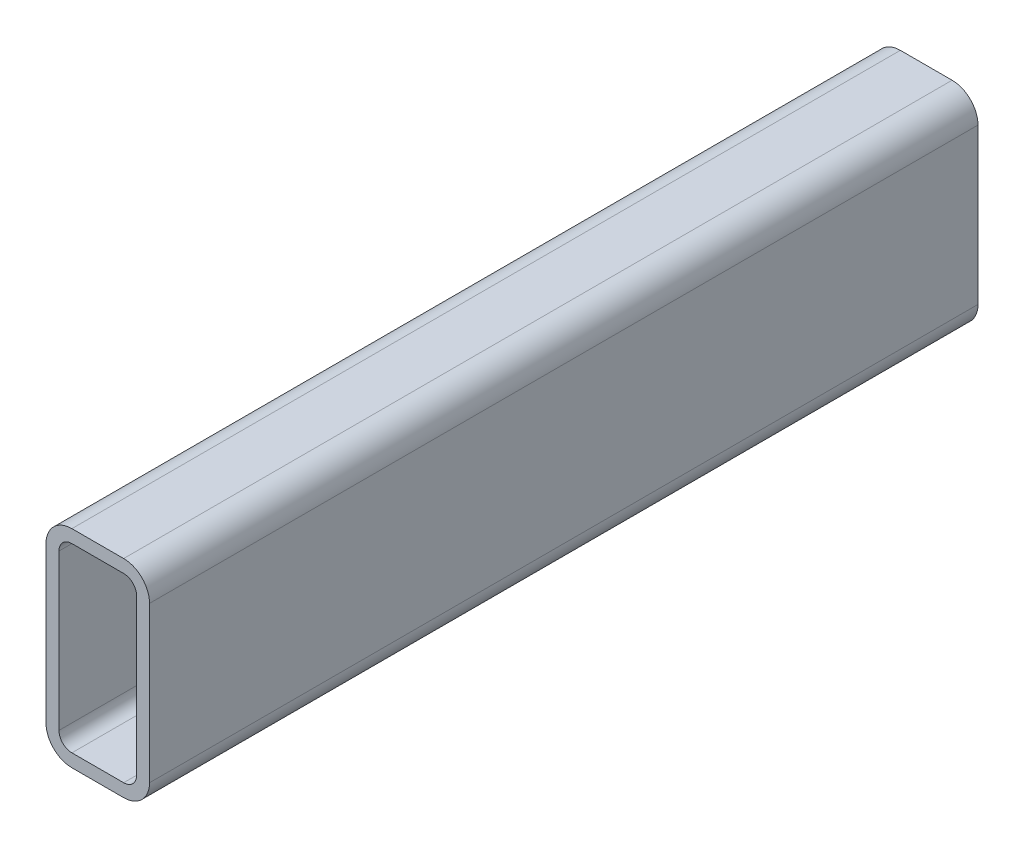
ISO-10303-21;
HEADER;
FILE_DESCRIPTION(('STEP AP214'),'2;1');
FILE_NAME('part.step','',(''),(''),'','','');
FILE_SCHEMA(('AUTOMOTIVE_DESIGN { 1 0 10303 214 1 1 1 1 }'));
ENDSEC;
DATA;
#1=APPLICATION_CONTEXT('core data for automotive mechanical design processes');
#2=APPLICATION_PROTOCOL_DEFINITION('international standard','automotive_design',2000,#1);
#3=PRODUCT_CONTEXT('',#1,'mechanical');
#4=PRODUCT('Part','Part','',(#3));
#5=PRODUCT_RELATED_PRODUCT_CATEGORY('part','',(#4));
#6=PRODUCT_DEFINITION_FORMATION('','',#4);
#7=PRODUCT_DEFINITION_CONTEXT('part definition',#1,'design');
#8=PRODUCT_DEFINITION('design','',#6,#7);
#9=PRODUCT_DEFINITION_SHAPE('','',#8);
#10=(LENGTH_UNIT() NAMED_UNIT(*) SI_UNIT(.MILLI.,.METRE.));
#11=(NAMED_UNIT(*) PLANE_ANGLE_UNIT() SI_UNIT($,.RADIAN.));
#12=(NAMED_UNIT(*) SI_UNIT($,.STERADIAN.) SOLID_ANGLE_UNIT());
#13=UNCERTAINTY_MEASURE_WITH_UNIT(LENGTH_MEASURE(1.E-05),#10,'distance_accuracy_value','');
#14=(GEOMETRIC_REPRESENTATION_CONTEXT(3) GLOBAL_UNCERTAINTY_ASSIGNED_CONTEXT((#13)) GLOBAL_UNIT_ASSIGNED_CONTEXT((#10,
#11,#12)) REPRESENTATION_CONTEXT('',''));
#15=CARTESIAN_POINT('',(0.,0.,0.));
#16=DIRECTION('',(0.,0.,1.));
#17=DIRECTION('',(1.,0.,0.));
#18=AXIS2_PLACEMENT_3D('',#15,#16,#17);
#19=CARTESIAN_POINT('',(9.525,66.675,304.8));
#20=DIRECTION('',(0.,0.,1.));
#21=DIRECTION('',(1.,0.,0.));
#22=AXIS2_PLACEMENT_3D('',#19,#20,#21);
#23=PLANE('',#22);
#24=CARTESIAN_POINT('',(9.525,66.675,304.8));
#25=DIRECTION('',(0.,0.,1.));
#26=DIRECTION('',(1.,0.,0.));
#27=AXIS2_PLACEMENT_3D('',#24,#25,#26);
#28=CIRCLE('',#27,9.52500000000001);
#29=CARTESIAN_POINT('',(9.525,76.2,304.8));
#30=VERTEX_POINT('',#29);
#31=CARTESIAN_POINT('',(0.,66.675,304.8));
#32=VERTEX_POINT('',#31);
#33=EDGE_CURVE('E211',#30,#32,#28,.T.);
#34=ORIENTED_EDGE('',*,*,#33,.T.);
#35=DIRECTION('',(0.,-1.,0.));
#36=VECTOR('',#35,1.);
#37=CARTESIAN_POINT('',(0.,9.525,304.8));
#38=LINE('',#37,#36);
#39=CARTESIAN_POINT('',(0.,9.525,304.8));
#40=VERTEX_POINT('',#39);
#41=EDGE_CURVE('E214',#32,#40,#38,.T.);
#42=ORIENTED_EDGE('',*,*,#41,.T.);
#43=CARTESIAN_POINT('',(9.525,9.525,304.8));
#44=DIRECTION('',(0.,0.,1.));
#45=DIRECTION('',(1.,0.,0.));
#46=AXIS2_PLACEMENT_3D('',#43,#44,#45);
#47=CIRCLE('',#46,9.525);
#48=CARTESIAN_POINT('',(9.525,0.,304.8));
#49=VERTEX_POINT('',#48);
#50=EDGE_CURVE('E217',#40,#49,#47,.T.);
#51=ORIENTED_EDGE('',*,*,#50,.T.);
#52=DIRECTION('',(1.,0.,0.));
#53=VECTOR('',#52,1.);
#54=CARTESIAN_POINT('',(28.575,0.,304.8));
#55=LINE('',#54,#53);
#56=CARTESIAN_POINT('',(28.575,0.,304.8));
#57=VERTEX_POINT('',#56);
#58=EDGE_CURVE('E219',#49,#57,#55,.T.);
#59=ORIENTED_EDGE('',*,*,#58,.T.);
#60=CARTESIAN_POINT('',(28.575,9.525,304.8));
#61=DIRECTION('',(0.,0.,1.));
#62=DIRECTION('',(1.,0.,0.));
#63=AXIS2_PLACEMENT_3D('',#60,#61,#62);
#64=CIRCLE('',#63,9.525);
#65=CARTESIAN_POINT('',(38.1,9.525,304.8));
#66=VERTEX_POINT('',#65);
#67=EDGE_CURVE('E221',#57,#66,#64,.T.);
#68=ORIENTED_EDGE('',*,*,#67,.T.);
#69=DIRECTION('',(0.,1.,0.));
#70=VECTOR('',#69,1.);
#71=CARTESIAN_POINT('',(38.1,66.675,304.8));
#72=LINE('',#71,#70);
#73=CARTESIAN_POINT('',(38.1,66.675,304.8));
#74=VERTEX_POINT('',#73);
#75=EDGE_CURVE('E223',#66,#74,#72,.T.);
#76=ORIENTED_EDGE('',*,*,#75,.T.);
#77=CARTESIAN_POINT('',(28.575,66.675,304.8));
#78=DIRECTION('',(0.,0.,1.));
#79=DIRECTION('',(1.,0.,0.));
#80=AXIS2_PLACEMENT_3D('',#77,#78,#79);
#81=CIRCLE('',#80,9.52500000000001);
#82=CARTESIAN_POINT('',(28.575,76.2,304.8));
#83=VERTEX_POINT('',#82);
#84=EDGE_CURVE('E225',#74,#83,#81,.T.);
#85=ORIENTED_EDGE('',*,*,#84,.T.);
#86=DIRECTION('',(-1.,0.,0.));
#87=VECTOR('',#86,1.);
#88=CARTESIAN_POINT('',(9.525,76.2,304.8));
#89=LINE('',#88,#87);
#90=EDGE_CURVE('E227',#83,#30,#89,.T.);
#91=ORIENTED_EDGE('',*,*,#90,.T.);
#92=EDGE_LOOP('',(#34,#42,#51,#59,#68,#76,#85,#91));
#93=FACE_BOUND('',#92,.T.);
#94=DIRECTION('',(0.,-1.,0.));
#95=VECTOR('',#94,1.);
#96=CARTESIAN_POINT('',(4.7625,9.525,304.8));
#97=LINE('',#96,#95);
#98=CARTESIAN_POINT('',(4.7625,66.675,304.8));
#99=VERTEX_POINT('',#98);
#100=CARTESIAN_POINT('',(4.7625,9.525,304.8));
#101=VERTEX_POINT('',#100);
#102=EDGE_CURVE('E154',#99,#101,#97,.T.);
#103=ORIENTED_EDGE('',*,*,#102,.F.);
#104=CARTESIAN_POINT('',(9.525,66.675,304.8));
#105=DIRECTION('',(0.,0.,1.));
#106=DIRECTION('',(1.,0.,0.));
#107=AXIS2_PLACEMENT_3D('',#104,#105,#106);
#108=CIRCLE('',#107,4.7625);
#109=CARTESIAN_POINT('',(9.525,71.4375,304.8));
#110=VERTEX_POINT('',#109);
#111=EDGE_CURVE('E146',#110,#99,#108,.T.);
#112=ORIENTED_EDGE('',*,*,#111,.F.);
#113=DIRECTION('',(-1.,0.,0.));
#114=VECTOR('',#113,1.);
#115=CARTESIAN_POINT('',(9.525,71.4375,304.8));
#116=LINE('',#115,#114);
#117=CARTESIAN_POINT('',(28.575,71.4375,304.8));
#118=VERTEX_POINT('',#117);
#119=EDGE_CURVE('E179',#118,#110,#116,.T.);
#120=ORIENTED_EDGE('',*,*,#119,.F.);
#121=CARTESIAN_POINT('',(28.575,66.675,304.8));
#122=DIRECTION('',(0.,0.,1.));
#123=DIRECTION('',(1.,0.,0.));
#124=AXIS2_PLACEMENT_3D('',#121,#122,#123);
#125=CIRCLE('',#124,4.7625);
#126=CARTESIAN_POINT('',(33.3375,66.675,304.8));
#127=VERTEX_POINT('',#126);
#128=EDGE_CURVE('E177',#127,#118,#125,.T.);
#129=ORIENTED_EDGE('',*,*,#128,.F.);
#130=DIRECTION('',(0.,1.,0.));
#131=VECTOR('',#130,1.);
#132=CARTESIAN_POINT('',(33.3375,66.675,304.8));
#133=LINE('',#132,#131);
#134=CARTESIAN_POINT('',(33.3375,9.525,304.8));
#135=VERTEX_POINT('',#134);
#136=EDGE_CURVE('E175',#135,#127,#133,.T.);
#137=ORIENTED_EDGE('',*,*,#136,.F.);
#138=CARTESIAN_POINT('',(28.575,9.525,304.8));
#139=DIRECTION('',(0.,0.,1.));
#140=DIRECTION('',(1.,0.,0.));
#141=AXIS2_PLACEMENT_3D('',#138,#139,#140);
#142=CIRCLE('',#141,4.7625);
#143=CARTESIAN_POINT('',(28.575,4.7625,304.8));
#144=VERTEX_POINT('',#143);
#145=EDGE_CURVE('E173',#144,#135,#142,.T.);
#146=ORIENTED_EDGE('',*,*,#145,.F.);
#147=DIRECTION('',(1.,0.,0.));
#148=VECTOR('',#147,1.);
#149=CARTESIAN_POINT('',(28.575,4.7625,304.8));
#150=LINE('',#149,#148);
#151=CARTESIAN_POINT('',(9.525,4.7625,304.8));
#152=VERTEX_POINT('',#151);
#153=EDGE_CURVE('E169',#152,#144,#150,.T.);
#154=ORIENTED_EDGE('',*,*,#153,.F.);
#155=CARTESIAN_POINT('',(9.525,9.525,304.8));
#156=DIRECTION('',(0.,0.,1.));
#157=DIRECTION('',(1.,0.,0.));
#158=AXIS2_PLACEMENT_3D('',#155,#156,#157);
#159=CIRCLE('',#158,4.7625);
#160=EDGE_CURVE('E167',#101,#152,#159,.T.);
#161=ORIENTED_EDGE('',*,*,#160,.F.);
#162=EDGE_LOOP('',(#103,#112,#120,#129,#137,#146,#154,#161));
#163=FACE_BOUND('',#162,.T.);
#164=ADVANCED_FACE('F33',(#93,#163),#23,.T.);
#165=CARTESIAN_POINT('',(9.525,66.675,0.));
#166=DIRECTION('',(0.,0.,1.));
#167=DIRECTION('',(1.,0.,0.));
#168=AXIS2_PLACEMENT_3D('',#165,#166,#167);
#169=PLANE('',#168);
#170=CARTESIAN_POINT('',(9.525,66.675,0.));
#171=DIRECTION('',(0.,0.,1.));
#172=DIRECTION('',(1.,0.,0.));
#173=AXIS2_PLACEMENT_3D('',#170,#171,#172);
#174=CIRCLE('',#173,9.52500000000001);
#175=CARTESIAN_POINT('',(9.525,76.2,0.));
#176=VERTEX_POINT('',#175);
#177=CARTESIAN_POINT('',(0.,66.675,0.));
#178=VERTEX_POINT('',#177);
#179=EDGE_CURVE('E162',#176,#178,#174,.T.);
#180=ORIENTED_EDGE('',*,*,#179,.F.);
#181=DIRECTION('',(-1.,0.,0.));
#182=VECTOR('',#181,1.);
#183=CARTESIAN_POINT('',(9.525,76.2,0.));
#184=LINE('',#183,#182);
#185=CARTESIAN_POINT('',(28.575,76.2,0.));
#186=VERTEX_POINT('',#185);
#187=EDGE_CURVE('E215',#186,#176,#184,.T.);
#188=ORIENTED_EDGE('',*,*,#187,.F.);
#189=CARTESIAN_POINT('',(28.575,66.675,0.));
#190=DIRECTION('',(0.,0.,1.));
#191=DIRECTION('',(1.,0.,0.));
#192=AXIS2_PLACEMENT_3D('',#189,#190,#191);
#193=CIRCLE('',#192,9.52500000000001);
#194=CARTESIAN_POINT('',(38.1,66.675,0.));
#195=VERTEX_POINT('',#194);
#196=EDGE_CURVE('E242',#195,#186,#193,.T.);
#197=ORIENTED_EDGE('',*,*,#196,.F.);
#198=DIRECTION('',(0.,1.,0.));
#199=VECTOR('',#198,1.);
#200=CARTESIAN_POINT('',(38.1,66.675,0.));
#201=LINE('',#200,#199);
#202=CARTESIAN_POINT('',(38.1,9.525,0.));
#203=VERTEX_POINT('',#202);
#204=EDGE_CURVE('E240',#203,#195,#201,.T.);
#205=ORIENTED_EDGE('',*,*,#204,.F.);
#206=CARTESIAN_POINT('',(28.575,9.525,0.));
#207=DIRECTION('',(0.,0.,1.));
#208=DIRECTION('',(1.,0.,0.));
#209=AXIS2_PLACEMENT_3D('',#206,#207,#208);
#210=CIRCLE('',#209,9.525);
#211=CARTESIAN_POINT('',(28.575,0.,0.));
#212=VERTEX_POINT('',#211);
#213=EDGE_CURVE('E238',#212,#203,#210,.T.);
#214=ORIENTED_EDGE('',*,*,#213,.F.);
#215=DIRECTION('',(1.,0.,0.));
#216=VECTOR('',#215,1.);
#217=CARTESIAN_POINT('',(28.575,0.,0.));
#218=LINE('',#217,#216);
#219=CARTESIAN_POINT('',(9.525,0.,0.));
#220=VERTEX_POINT('',#219);
#221=EDGE_CURVE('E236',#220,#212,#218,.T.);
#222=ORIENTED_EDGE('',*,*,#221,.F.);
#223=CARTESIAN_POINT('',(9.525,9.525,0.));
#224=DIRECTION('',(0.,0.,1.));
#225=DIRECTION('',(1.,0.,0.));
#226=AXIS2_PLACEMENT_3D('',#223,#224,#225);
#227=CIRCLE('',#226,9.525);
#228=CARTESIAN_POINT('',(0.,9.525,0.));
#229=VERTEX_POINT('',#228);
#230=EDGE_CURVE('E234',#229,#220,#227,.T.);
#231=ORIENTED_EDGE('',*,*,#230,.F.);
#232=DIRECTION('',(0.,-1.,0.));
#233=VECTOR('',#232,1.);
#234=CARTESIAN_POINT('',(0.,9.525,0.));
#235=LINE('',#234,#233);
#236=EDGE_CURVE('E232',#178,#229,#235,.T.);
#237=ORIENTED_EDGE('',*,*,#236,.F.);
#238=EDGE_LOOP('',(#180,#188,#197,#205,#214,#222,#231,#237));
#239=FACE_BOUND('',#238,.T.);
#240=CARTESIAN_POINT('',(9.525,66.675,0.));
#241=DIRECTION('',(0.,0.,1.));
#242=DIRECTION('',(1.,0.,0.));
#243=AXIS2_PLACEMENT_3D('',#240,#241,#242);
#244=CIRCLE('',#243,4.7625);
#245=CARTESIAN_POINT('',(9.525,71.4375,0.));
#246=VERTEX_POINT('',#245);
#247=CARTESIAN_POINT('',(4.7625,66.675,0.));
#248=VERTEX_POINT('',#247);
#249=EDGE_CURVE('E56',#246,#248,#244,.T.);
#250=ORIENTED_EDGE('',*,*,#249,.T.);
#251=DIRECTION('',(0.,-1.,0.));
#252=VECTOR('',#251,1.);
#253=CARTESIAN_POINT('',(4.7625,9.525,0.));
#254=LINE('',#253,#252);
#255=CARTESIAN_POINT('',(4.7625,9.525,0.));
#256=VERTEX_POINT('',#255);
#257=EDGE_CURVE('E161',#248,#256,#254,.T.);
#258=ORIENTED_EDGE('',*,*,#257,.T.);
#259=CARTESIAN_POINT('',(9.525,9.525,0.));
#260=DIRECTION('',(0.,0.,1.));
#261=DIRECTION('',(1.,0.,0.));
#262=AXIS2_PLACEMENT_3D('',#259,#260,#261);
#263=CIRCLE('',#262,4.7625);
#264=CARTESIAN_POINT('',(9.525,4.7625,0.));
#265=VERTEX_POINT('',#264);
#266=EDGE_CURVE('E183',#256,#265,#263,.T.);
#267=ORIENTED_EDGE('',*,*,#266,.T.);
#268=DIRECTION('',(1.,0.,0.));
#269=VECTOR('',#268,1.);
#270=CARTESIAN_POINT('',(28.575,4.7625,0.));
#271=LINE('',#270,#269);
#272=CARTESIAN_POINT('',(28.575,4.7625,0.));
#273=VERTEX_POINT('',#272);
#274=EDGE_CURVE('E186',#265,#273,#271,.T.);
#275=ORIENTED_EDGE('',*,*,#274,.T.);
#276=CARTESIAN_POINT('',(28.575,9.525,0.));
#277=DIRECTION('',(0.,0.,1.));
#278=DIRECTION('',(1.,0.,0.));
#279=AXIS2_PLACEMENT_3D('',#276,#277,#278);
#280=CIRCLE('',#279,4.7625);
#281=CARTESIAN_POINT('',(33.3375,9.525,0.));
#282=VERTEX_POINT('',#281);
#283=EDGE_CURVE('E189',#273,#282,#280,.T.);
#284=ORIENTED_EDGE('',*,*,#283,.T.);
#285=DIRECTION('',(0.,1.,0.));
#286=VECTOR('',#285,1.);
#287=CARTESIAN_POINT('',(33.3375,66.675,0.));
#288=LINE('',#287,#286);
#289=CARTESIAN_POINT('',(33.3375,66.675,0.));
#290=VERTEX_POINT('',#289);
#291=EDGE_CURVE('E192',#282,#290,#288,.T.);
#292=ORIENTED_EDGE('',*,*,#291,.T.);
#293=CARTESIAN_POINT('',(28.575,66.675,0.));
#294=DIRECTION('',(0.,0.,1.));
#295=DIRECTION('',(1.,0.,0.));
#296=AXIS2_PLACEMENT_3D('',#293,#294,#295);
#297=CIRCLE('',#296,4.7625);
#298=CARTESIAN_POINT('',(28.575,71.4375,0.));
#299=VERTEX_POINT('',#298);
#300=EDGE_CURVE('E195',#290,#299,#297,.T.);
#301=ORIENTED_EDGE('',*,*,#300,.T.);
#302=DIRECTION('',(-1.,0.,0.));
#303=VECTOR('',#302,1.);
#304=CARTESIAN_POINT('',(9.525,71.4375,0.));
#305=LINE('',#304,#303);
#306=EDGE_CURVE('E155',#299,#246,#305,.T.);
#307=ORIENTED_EDGE('',*,*,#306,.T.);
#308=EDGE_LOOP('',(#250,#258,#267,#275,#284,#292,#301,#307));
#309=FACE_BOUND('',#308,.T.);
#310=ADVANCED_FACE('F272',(#239,#309),#169,.F.);
#311=CARTESIAN_POINT('',(9.525,66.675,304.8));
#312=DIRECTION('',(0.,0.,-1.));
#313=DIRECTION('',(-1.,0.,0.));
#314=AXIS2_PLACEMENT_3D('',#311,#312,#313);
#315=CYLINDRICAL_SURFACE('',#314,9.52500000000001);
#316=ORIENTED_EDGE('',*,*,#179,.T.);
#317=DIRECTION('',(0.,0.,-1.));
#318=VECTOR('',#317,1.);
#319=CARTESIAN_POINT('',(0.,66.675,304.8));
#320=LINE('',#319,#318);
#321=EDGE_CURVE('E11',#32,#178,#320,.T.);
#322=ORIENTED_EDGE('',*,*,#321,.F.);
#323=ORIENTED_EDGE('',*,*,#33,.F.);
#324=DIRECTION('',(0.,0.,-1.));
#325=VECTOR('',#324,1.);
#326=CARTESIAN_POINT('',(9.525,76.2,304.8));
#327=LINE('',#326,#325);
#328=EDGE_CURVE('E229',#30,#176,#327,.T.);
#329=ORIENTED_EDGE('',*,*,#328,.T.);
#330=EDGE_LOOP('',(#316,#322,#323,#329));
#331=FACE_BOUND('',#330,.T.);
#332=ADVANCED_FACE('F35',(#331),#315,.T.);
#333=CARTESIAN_POINT('',(0.,9.525,304.8));
#334=DIRECTION('',(1.,0.,0.));
#335=DIRECTION('',(0.,0.,-1.));
#336=AXIS2_PLACEMENT_3D('',#333,#334,#335);
#337=PLANE('',#336);
#338=ORIENTED_EDGE('',*,*,#236,.T.);
#339=DIRECTION('',(0.,0.,-1.));
#340=VECTOR('',#339,1.);
#341=CARTESIAN_POINT('',(0.,9.525,304.8));
#342=LINE('',#341,#340);
#343=EDGE_CURVE('E41',#40,#229,#342,.T.);
#344=ORIENTED_EDGE('',*,*,#343,.F.);
#345=ORIENTED_EDGE('',*,*,#41,.F.);
#346=ORIENTED_EDGE('',*,*,#321,.T.);
#347=EDGE_LOOP('',(#338,#344,#345,#346));
#348=FACE_BOUND('',#347,.T.);
#349=ADVANCED_FACE('F289',(#348),#337,.F.);
#350=CARTESIAN_POINT('',(9.525,9.525,304.8));
#351=DIRECTION('',(0.,0.,-1.));
#352=DIRECTION('',(-1.,0.,0.));
#353=AXIS2_PLACEMENT_3D('',#350,#351,#352);
#354=CYLINDRICAL_SURFACE('',#353,9.525);
#355=ORIENTED_EDGE('',*,*,#230,.T.);
#356=DIRECTION('',(0.,0.,-1.));
#357=VECTOR('',#356,1.);
#358=CARTESIAN_POINT('',(9.525,0.,304.8));
#359=LINE('',#358,#357);
#360=EDGE_CURVE('E259',#49,#220,#359,.T.);
#361=ORIENTED_EDGE('',*,*,#360,.F.);
#362=ORIENTED_EDGE('',*,*,#50,.F.);
#363=ORIENTED_EDGE('',*,*,#343,.T.);
#364=EDGE_LOOP('',(#355,#361,#362,#363));
#365=FACE_BOUND('',#364,.T.);
#366=ADVANCED_FACE('F266',(#365),#354,.T.);
#367=CARTESIAN_POINT('',(28.575,0.,304.8));
#368=DIRECTION('',(0.,1.,0.));
#369=DIRECTION('',(0.,0.,1.));
#370=AXIS2_PLACEMENT_3D('',#367,#368,#369);
#371=PLANE('',#370);
#372=ORIENTED_EDGE('',*,*,#221,.T.);
#373=DIRECTION('',(0.,0.,-1.));
#374=VECTOR('',#373,1.);
#375=CARTESIAN_POINT('',(28.575,0.,304.8));
#376=LINE('',#375,#374);
#377=EDGE_CURVE('E256',#57,#212,#376,.T.);
#378=ORIENTED_EDGE('',*,*,#377,.F.);
#379=ORIENTED_EDGE('',*,*,#58,.F.);
#380=ORIENTED_EDGE('',*,*,#360,.T.);
#381=EDGE_LOOP('',(#372,#378,#379,#380));
#382=FACE_BOUND('',#381,.T.);
#383=ADVANCED_FACE('F278',(#382),#371,.F.);
#384=CARTESIAN_POINT('',(28.575,9.525,304.8));
#385=DIRECTION('',(0.,0.,-1.));
#386=DIRECTION('',(-1.,0.,0.));
#387=AXIS2_PLACEMENT_3D('',#384,#385,#386);
#388=CYLINDRICAL_SURFACE('',#387,9.525);
#389=ORIENTED_EDGE('',*,*,#213,.T.);
#390=DIRECTION('',(0.,0.,-1.));
#391=VECTOR('',#390,1.);
#392=CARTESIAN_POINT('',(38.1,9.525,304.8));
#393=LINE('',#392,#391);
#394=EDGE_CURVE('E253',#66,#203,#393,.T.);
#395=ORIENTED_EDGE('',*,*,#394,.F.);
#396=ORIENTED_EDGE('',*,*,#67,.F.);
#397=ORIENTED_EDGE('',*,*,#377,.T.);
#398=EDGE_LOOP('',(#389,#395,#396,#397));
#399=FACE_BOUND('',#398,.T.);
#400=ADVANCED_FACE('F282',(#399),#388,.T.);
#401=CARTESIAN_POINT('',(38.1,66.675,304.8));
#402=DIRECTION('',(-1.,0.,0.));
#403=DIRECTION('',(0.,0.,1.));
#404=AXIS2_PLACEMENT_3D('',#401,#402,#403);
#405=PLANE('',#404);
#406=ORIENTED_EDGE('',*,*,#204,.T.);
#407=DIRECTION('',(0.,0.,-1.));
#408=VECTOR('',#407,1.);
#409=CARTESIAN_POINT('',(38.1,66.675,304.8));
#410=LINE('',#409,#408);
#411=EDGE_CURVE('E250',#74,#195,#410,.T.);
#412=ORIENTED_EDGE('',*,*,#411,.F.);
#413=ORIENTED_EDGE('',*,*,#75,.F.);
#414=ORIENTED_EDGE('',*,*,#394,.T.);
#415=EDGE_LOOP('',(#406,#412,#413,#414));
#416=FACE_BOUND('',#415,.T.);
#417=ADVANCED_FACE('F302',(#416),#405,.F.);
#418=CARTESIAN_POINT('',(28.575,66.675,304.8));
#419=DIRECTION('',(0.,0.,-1.));
#420=DIRECTION('',(-1.,0.,0.));
#421=AXIS2_PLACEMENT_3D('',#418,#419,#420);
#422=CYLINDRICAL_SURFACE('',#421,9.52500000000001);
#423=ORIENTED_EDGE('',*,*,#196,.T.);
#424=DIRECTION('',(0.,0.,-1.));
#425=VECTOR('',#424,1.);
#426=CARTESIAN_POINT('',(28.575,76.2,304.8));
#427=LINE('',#426,#425);
#428=EDGE_CURVE('E247',#83,#186,#427,.T.);
#429=ORIENTED_EDGE('',*,*,#428,.F.);
#430=ORIENTED_EDGE('',*,*,#84,.F.);
#431=ORIENTED_EDGE('',*,*,#411,.T.);
#432=EDGE_LOOP('',(#423,#429,#430,#431));
#433=FACE_BOUND('',#432,.T.);
#434=ADVANCED_FACE('F300',(#433),#422,.T.);
#435=CARTESIAN_POINT('',(9.525,76.2,304.8));
#436=DIRECTION('',(0.,-1.,0.));
#437=DIRECTION('',(0.,0.,-1.));
#438=AXIS2_PLACEMENT_3D('',#435,#436,#437);
#439=PLANE('',#438);
#440=ORIENTED_EDGE('',*,*,#187,.T.);
#441=ORIENTED_EDGE('',*,*,#328,.F.);
#442=ORIENTED_EDGE('',*,*,#90,.F.);
#443=ORIENTED_EDGE('',*,*,#428,.T.);
#444=EDGE_LOOP('',(#440,#441,#442,#443));
#445=FACE_BOUND('',#444,.T.);
#446=ADVANCED_FACE('F295',(#445),#439,.F.);
#447=CARTESIAN_POINT('',(9.525,66.675,304.8));
#448=DIRECTION('',(0.,0.,-1.));
#449=DIRECTION('',(-1.,0.,0.));
#450=AXIS2_PLACEMENT_3D('',#447,#448,#449);
#451=CYLINDRICAL_SURFACE('',#450,4.7625);
#452=ORIENTED_EDGE('',*,*,#249,.F.);
#453=DIRECTION('',(0.,0.,-1.));
#454=VECTOR('',#453,1.);
#455=CARTESIAN_POINT('',(9.525,71.4375,304.8));
#456=LINE('',#455,#454);
#457=EDGE_CURVE('E150',#110,#246,#456,.T.);
#458=ORIENTED_EDGE('',*,*,#457,.F.);
#459=ORIENTED_EDGE('',*,*,#111,.T.);
#460=DIRECTION('',(0.,0.,-1.));
#461=VECTOR('',#460,1.);
#462=CARTESIAN_POINT('',(4.7625,66.675,304.8));
#463=LINE('',#462,#461);
#464=EDGE_CURVE('E149',#99,#248,#463,.T.);
#465=ORIENTED_EDGE('',*,*,#464,.T.);
#466=EDGE_LOOP('',(#452,#458,#459,#465));
#467=FACE_BOUND('',#466,.T.);
#468=ADVANCED_FACE('F148',(#467),#451,.F.);
#469=CARTESIAN_POINT('',(4.7625,9.525,304.8));
#470=DIRECTION('',(1.,0.,0.));
#471=DIRECTION('',(0.,0.,-1.));
#472=AXIS2_PLACEMENT_3D('',#469,#470,#471);
#473=PLANE('',#472);
#474=ORIENTED_EDGE('',*,*,#257,.F.);
#475=ORIENTED_EDGE('',*,*,#464,.F.);
#476=ORIENTED_EDGE('',*,*,#102,.T.);
#477=DIRECTION('',(0.,0.,-1.));
#478=VECTOR('',#477,1.);
#479=CARTESIAN_POINT('',(4.7625,9.525,304.8));
#480=LINE('',#479,#478);
#481=EDGE_CURVE('E163',#101,#256,#480,.T.);
#482=ORIENTED_EDGE('',*,*,#481,.T.);
#483=EDGE_LOOP('',(#474,#475,#476,#482));
#484=FACE_BOUND('',#483,.T.);
#485=ADVANCED_FACE('F158',(#484),#473,.T.);
#486=CARTESIAN_POINT('',(9.525,9.525,304.8));
#487=DIRECTION('',(0.,0.,-1.));
#488=DIRECTION('',(-1.,0.,0.));
#489=AXIS2_PLACEMENT_3D('',#486,#487,#488);
#490=CYLINDRICAL_SURFACE('',#489,4.7625);
#491=ORIENTED_EDGE('',*,*,#266,.F.);
#492=ORIENTED_EDGE('',*,*,#481,.F.);
#493=ORIENTED_EDGE('',*,*,#160,.T.);
#494=DIRECTION('',(0.,0.,-1.));
#495=VECTOR('',#494,1.);
#496=CARTESIAN_POINT('',(9.525,4.7625,304.8));
#497=LINE('',#496,#495);
#498=EDGE_CURVE('E208',#152,#265,#497,.T.);
#499=ORIENTED_EDGE('',*,*,#498,.T.);
#500=EDGE_LOOP('',(#491,#492,#493,#499));
#501=FACE_BOUND('',#500,.T.);
#502=ADVANCED_FACE('F327',(#501),#490,.F.);
#503=CARTESIAN_POINT('',(28.575,4.7625,304.8));
#504=DIRECTION('',(0.,1.,0.));
#505=DIRECTION('',(0.,0.,1.));
#506=AXIS2_PLACEMENT_3D('',#503,#504,#505);
#507=PLANE('',#506);
#508=ORIENTED_EDGE('',*,*,#274,.F.);
#509=ORIENTED_EDGE('',*,*,#498,.F.);
#510=ORIENTED_EDGE('',*,*,#153,.T.);
#511=DIRECTION('',(0.,0.,-1.));
#512=VECTOR('',#511,1.);
#513=CARTESIAN_POINT('',(28.575,4.7625,304.8));
#514=LINE('',#513,#512);
#515=EDGE_CURVE('E206',#144,#273,#514,.T.);
#516=ORIENTED_EDGE('',*,*,#515,.T.);
#517=EDGE_LOOP('',(#508,#509,#510,#516));
#518=FACE_BOUND('',#517,.T.);
#519=ADVANCED_FACE('F331',(#518),#507,.T.);
#520=CARTESIAN_POINT('',(28.575,9.525,304.8));
#521=DIRECTION('',(0.,0.,-1.));
#522=DIRECTION('',(-1.,0.,0.));
#523=AXIS2_PLACEMENT_3D('',#520,#521,#522);
#524=CYLINDRICAL_SURFACE('',#523,4.7625);
#525=ORIENTED_EDGE('',*,*,#283,.F.);
#526=ORIENTED_EDGE('',*,*,#515,.F.);
#527=ORIENTED_EDGE('',*,*,#145,.T.);
#528=DIRECTION('',(0.,0.,-1.));
#529=VECTOR('',#528,1.);
#530=CARTESIAN_POINT('',(33.3375,9.525,304.8));
#531=LINE('',#530,#529);
#532=EDGE_CURVE('E204',#135,#282,#531,.T.);
#533=ORIENTED_EDGE('',*,*,#532,.T.);
#534=EDGE_LOOP('',(#525,#526,#527,#533));
#535=FACE_BOUND('',#534,.T.);
#536=ADVANCED_FACE('F337',(#535),#524,.F.);
#537=CARTESIAN_POINT('',(33.3375,66.675,304.8));
#538=DIRECTION('',(-1.,0.,0.));
#539=DIRECTION('',(0.,0.,1.));
#540=AXIS2_PLACEMENT_3D('',#537,#538,#539);
#541=PLANE('',#540);
#542=ORIENTED_EDGE('',*,*,#291,.F.);
#543=ORIENTED_EDGE('',*,*,#532,.F.);
#544=ORIENTED_EDGE('',*,*,#136,.T.);
#545=DIRECTION('',(0.,0.,-1.));
#546=VECTOR('',#545,1.);
#547=CARTESIAN_POINT('',(33.3375,66.675,304.8));
#548=LINE('',#547,#546);
#549=EDGE_CURVE('E202',#127,#290,#548,.T.);
#550=ORIENTED_EDGE('',*,*,#549,.T.);
#551=EDGE_LOOP('',(#542,#543,#544,#550));
#552=FACE_BOUND('',#551,.T.);
#553=ADVANCED_FACE('F341',(#552),#541,.T.);
#554=CARTESIAN_POINT('',(28.575,66.675,304.8));
#555=DIRECTION('',(0.,0.,-1.));
#556=DIRECTION('',(-1.,0.,0.));
#557=AXIS2_PLACEMENT_3D('',#554,#555,#556);
#558=CYLINDRICAL_SURFACE('',#557,4.7625);
#559=ORIENTED_EDGE('',*,*,#300,.F.);
#560=ORIENTED_EDGE('',*,*,#549,.F.);
#561=ORIENTED_EDGE('',*,*,#128,.T.);
#562=DIRECTION('',(0.,0.,-1.));
#563=VECTOR('',#562,1.);
#564=CARTESIAN_POINT('',(28.575,71.4375,304.8));
#565=LINE('',#564,#563);
#566=EDGE_CURVE('E48',#118,#299,#565,.T.);
#567=ORIENTED_EDGE('',*,*,#566,.T.);
#568=EDGE_LOOP('',(#559,#560,#561,#567));
#569=FACE_BOUND('',#568,.T.);
#570=ADVANCED_FACE('F345',(#569),#558,.F.);
#571=CARTESIAN_POINT('',(9.525,71.4375,304.8));
#572=DIRECTION('',(0.,-1.,0.));
#573=DIRECTION('',(0.,0.,-1.));
#574=AXIS2_PLACEMENT_3D('',#571,#572,#573);
#575=PLANE('',#574);
#576=ORIENTED_EDGE('',*,*,#306,.F.);
#577=ORIENTED_EDGE('',*,*,#566,.F.);
#578=ORIENTED_EDGE('',*,*,#119,.T.);
#579=ORIENTED_EDGE('',*,*,#457,.T.);
#580=EDGE_LOOP('',(#576,#577,#578,#579));
#581=FACE_BOUND('',#580,.T.);
#582=ADVANCED_FACE('F349',(#581),#575,.T.);
#583=CLOSED_SHELL('',(#164,#310,#332,#349,#366,#383,#400,#417,#434,#446,#468,#485,#502,#519,
#536,#553,#570,#582));
#584=MANIFOLD_SOLID_BREP('B2',#583);
#585=ADVANCED_BREP_SHAPE_REPRESENTATION('',(#18,#584),#14);
#586=SHAPE_DEFINITION_REPRESENTATION(#9,#585);
ENDSEC;
END-ISO-10303-21;
